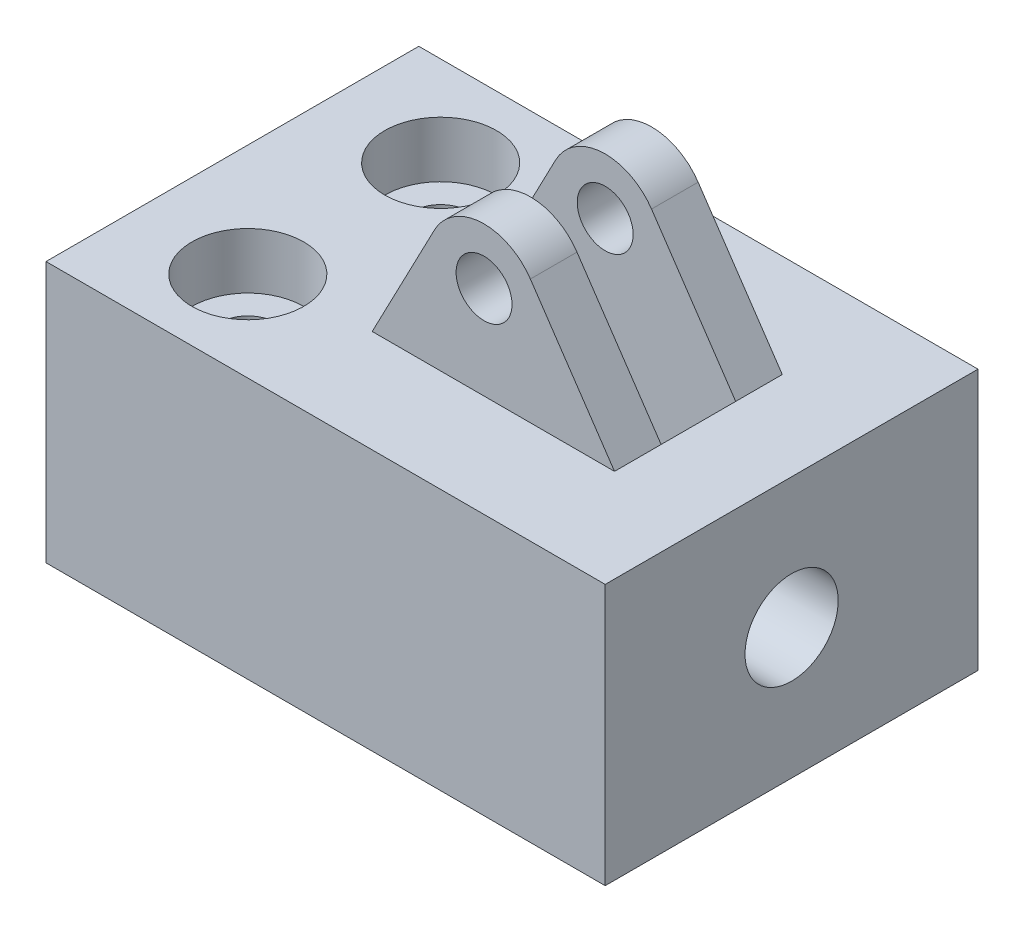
from build123d import *

# Parameters (mm, degrees)
SKETCH_1_W               = 60
SKETCH_1_H               = 28
EXTRUDE_1_DEPTH          = 20
SKETCH_2_R               = 6
CUT_EXTRUDE_1_DEPTH      = 16
SKETCH_3_R               = 5
CUT_EXTRUDE_2_DEPTH      = 51.318982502
SKETCH_4_R               = 6
CUT_EXTRUDE_3_DEPTH      = 6
SKETCH_5_R               = 3
CUT_EXTRUDE_4_DEPTH      = 43.237424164
SKETCH_6_R               = 3
EXTRUDE_2_DEPTH          = 5
CUT_EXTRUDE_5_DEPTH      = 4
CUT_EXTRUDE_6_REACH      = 60.31
CUT_EXTRUDE_6_END_RADIUS = 5
SKETCH_8_R               = 2.5


with BuildPart() as part:
    # Sketch 1 → Extrude 1 (new, symmetric)
    with BuildSketch(Plane.XY):
        Rectangle(SKETCH_1_W, SKETCH_1_H)
    extrude(amount=EXTRUDE_1_DEPTH, both=True)

    # Sketch 2 → Cut-Extrude 1 (cut)
    with BuildSketch(Plane.ZY.offset(30)):
        Circle(SKETCH_2_R)
    extrude(amount=-CUT_EXTRUDE_1_DEPTH, mode=Mode.SUBTRACT)

    # Sketch 3 → Cut-Extrude 2 (cut, through all)
    with BuildSketch(Plane.ZY.offset(14)):
        Circle(SKETCH_3_R)
    extrude(amount=-CUT_EXTRUDE_2_DEPTH, mode=Mode.SUBTRACT)

    # Sketch 4 → Cut-Extrude 3 (cut)
    with BuildSketch(Plane(origin=(0, 14, 0), x_dir=(1, 0, 0), z_dir=(0, 1, 0))):
        with Locations(Location((-18, 10.344827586, 0), (0, 0, 270))):
            Circle(SKETCH_4_R)
        with Locations(Location((-18, -10.344827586, 0), (0, 0, 90))):
            Circle(SKETCH_4_R)
    extrude(amount=-CUT_EXTRUDE_3_DEPTH, mode=Mode.SUBTRACT)

    # Sketch 5 → Cut-Extrude 4 (cut, through all)
    with BuildSketch(Plane(origin=(0, 8, 0), x_dir=(1, 0, 0), z_dir=(0, 1, 0))):
        with Locations(Location((-18, -10.344827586, 0), (0, 0, 270))):
            Circle(SKETCH_5_R)
        with Locations(Location((-18, 10.344827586, 0), (0, 0, 90))):
            Circle(SKETCH_5_R)
    extrude(amount=-CUT_EXTRUDE_4_DEPTH, mode=Mode.SUBTRACT)

    # Sketch 6 → Extrude 2 (add)
    with BuildSketch(Plane.XY.offset(4)):
        with BuildLine():
            Line((0.683064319, 26.780322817), (-6, 14))
            Line((-6, 14), (20, 14))
            Line((20, 14), (10.971185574, 27.359659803))
            ThreePointArc((10.971185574, 27.359659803), (5.6626669, 29.990509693), (0.683064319, 26.780322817))
        make_face()
        with Locations((6, 24)):
            Circle(SKETCH_6_R, mode=Mode.SUBTRACT)
    extrude_2 = extrude(amount=EXTRUDE_2_DEPTH)

    # Mirror 1: Extrude 2 across plane
    add(extrude_2.mirror(Plane.XY))

    # Sketch 7 → Cut-Extrude 5 (cut, symmetric)
    with BuildSketch(Plane.XY):
        Polygon((-6, 14), (-6, 4), (26.758266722, 4), (20, 14), align=None)
    extrude(amount=CUT_EXTRUDE_5_DEPTH, both=True, mode=Mode.SUBTRACT)

    # Cut-Extrude 6: up to this cylinder (the profile starts outside it)
    cut_extrude_6_end = Plane(origin=(6, 0, 0), z_dir=(-1, 0, 0)) * Cylinder(CUT_EXTRUDE_6_END_RADIUS, 131.62, mode=Mode.PRIVATE)
    # Sketch 8 → Cut-Extrude 6 (cut, up to the surface)
    with BuildSketch(Plane(origin=(0, 0, -20), x_dir=(-1, 0, 0), z_dir=(0, 0, -1)), mode=Mode.PRIVATE) as cut_extrude_6_sk1:
        with Locations((-6, 0)):
            Circle(SKETCH_8_R)
    cut_extrude_6_tool1 = extrude(cut_extrude_6_sk1.sketch, amount=-CUT_EXTRUDE_6_REACH, mode=Mode.PRIVATE) - cut_extrude_6_end
    add(cut_extrude_6_tool1.solids().sort_by_distance((6, 0, -20))[0], mode=Mode.SUBTRACT)


solid = part.part
